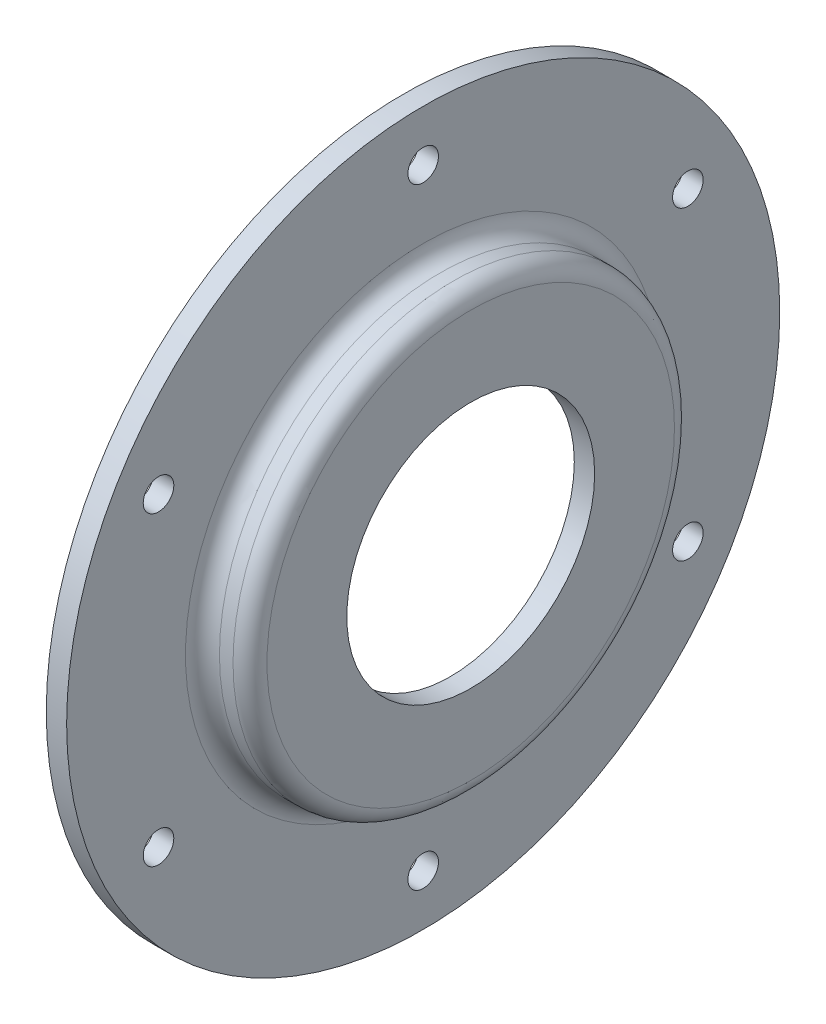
from build123d import *

# Parameters (mm, degrees)
SKETCH2_R          = 4.5
CUT_EXTRUDE1_DEPTH = 150.150930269
CIRPATTERN1_COUNT  = 6


with BuildPart() as part:
    # Sketch1 → Revolve1 (revolve)
    with BuildSketch(Plane.XY, mode=Mode.PRIVATE) as revolve1_sk:
        with BuildLine():
            Line((0, 59), (0, 36.5))
            Line((0, 36.5), (6, 36.5))
            Line((6, 36.5), (6, 60))
            ThreePointArc((6, 60), (4.535533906, 63.535533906), (1, 65))
            Line((1, 65), (-3, 65))
            ThreePointArc((-3, 65), (-6.535533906, 66.464466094), (-8, 70))
            Line((-8, 70), (-8, 105))
            Line((-8, 105), (-14, 105))
            Line((-14, 105), (-14, 59))
            Line((-14, 59), (0, 59))
        make_face()
    revolve(revolve1_sk.sketch.rotate(Axis((0, 0, 0), (-1, 0, 0)), 90), axis=Axis((0, 0, 0), (-1, 0, 0)))

    # Sketch2 → Cut-Extrude1 (cut, through all)
    with BuildSketch(Plane(origin=(-8, 0, 0), x_dir=(0, 0, -1), z_dir=(1, 0, 0))):
        with Locations((0, 90)):
            Circle(SKETCH2_R)
    cut_extrude1 = extrude(amount=-CUT_EXTRUDE1_DEPTH, mode=Mode.SUBTRACT)

    # CirPattern1: Cut-Extrude1 ×6 about axis
    cirpattern1_axis = Axis((0, 0, 0), (1, 0, 0))
    for i in range(1, CIRPATTERN1_COUNT):
        add(cut_extrude1.rotate(cirpattern1_axis, i * 360 / CIRPATTERN1_COUNT), mode=Mode.SUBTRACT)


solid = part.part
